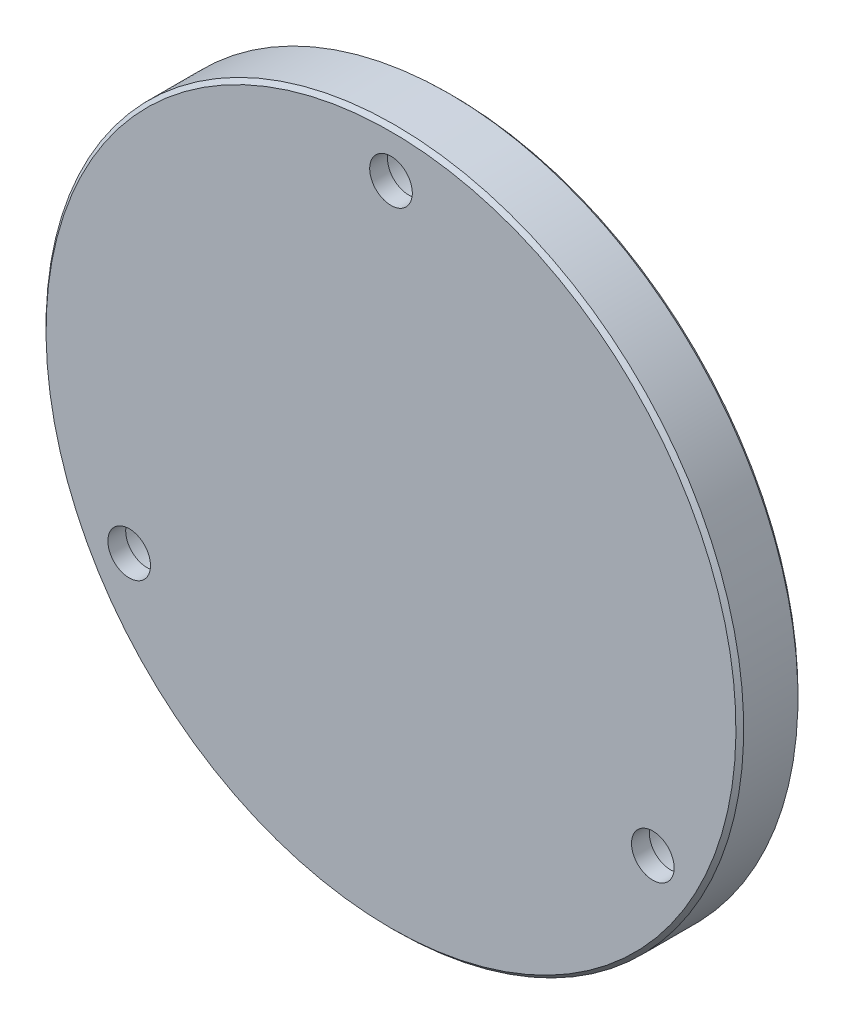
ISO-10303-21;
HEADER;
FILE_DESCRIPTION(('STEP AP214'),'2;1');
FILE_NAME('part.step','',(''),(''),'','','');
FILE_SCHEMA(('AUTOMOTIVE_DESIGN { 1 0 10303 214 1 1 1 1 }'));
ENDSEC;
DATA;
#1=APPLICATION_CONTEXT('core data for automotive mechanical design processes');
#2=APPLICATION_PROTOCOL_DEFINITION('international standard','automotive_design',2000,#1);
#3=PRODUCT_CONTEXT('',#1,'mechanical');
#4=PRODUCT('Part','Part','',(#3));
#5=PRODUCT_RELATED_PRODUCT_CATEGORY('part','',(#4));
#6=PRODUCT_DEFINITION_FORMATION('','',#4);
#7=PRODUCT_DEFINITION_CONTEXT('part definition',#1,'design');
#8=PRODUCT_DEFINITION('design','',#6,#7);
#9=PRODUCT_DEFINITION_SHAPE('','',#8);
#10=(LENGTH_UNIT() NAMED_UNIT(*) SI_UNIT(.MILLI.,.METRE.));
#11=(NAMED_UNIT(*) PLANE_ANGLE_UNIT() SI_UNIT($,.RADIAN.));
#12=(NAMED_UNIT(*) SI_UNIT($,.STERADIAN.) SOLID_ANGLE_UNIT());
#13=UNCERTAINTY_MEASURE_WITH_UNIT(LENGTH_MEASURE(1.E-05),#10,'distance_accuracy_value','');
#14=(GEOMETRIC_REPRESENTATION_CONTEXT(3) GLOBAL_UNCERTAINTY_ASSIGNED_CONTEXT((#13)) GLOBAL_UNIT_ASSIGNED_CONTEXT((#10,
#11,#12)) REPRESENTATION_CONTEXT('',''));
#15=CARTESIAN_POINT('',(0.,0.,0.));
#16=DIRECTION('',(0.,0.,1.));
#17=DIRECTION('',(1.,0.,0.));
#18=AXIS2_PLACEMENT_3D('',#15,#16,#17);
#19=CARTESIAN_POINT('',(0.,44.5,3.99999999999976));
#20=DIRECTION('',(0.,0.,-1.));
#21=DIRECTION('',(0.,1.,0.));
#22=AXIS2_PLACEMENT_3D('',#19,#20,#21);
#23=PLANE('',#22);
#24=CARTESIAN_POINT('',(0.,39.,4.00000000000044));
#25=DIRECTION('',(0.,0.,-1.));
#26=DIRECTION('',(-1.,0.,0.));
#27=AXIS2_PLACEMENT_3D('',#24,#25,#26);
#28=CIRCLE('',#27,2.75);
#29=CARTESIAN_POINT('',(-2.75000000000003,39.,4.00000000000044));
#30=VERTEX_POINT('',#29);
#31=EDGE_CURVE('E75',#30,#30,#28,.T.);
#32=ORIENTED_EDGE('',*,*,#31,.T.);
#33=EDGE_LOOP('',(#32));
#34=FACE_BOUND('',#33,.T.);
#35=CARTESIAN_POINT('',(-33.7749907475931,-19.5,4.00000000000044));
#36=DIRECTION('',(0.,0.,-1.));
#37=DIRECTION('',(-1.,0.,0.));
#38=AXIS2_PLACEMENT_3D('',#35,#36,#37);
#39=CIRCLE('',#38,2.75);
#40=CARTESIAN_POINT('',(-36.5249907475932,-19.5,4.00000000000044));
#41=VERTEX_POINT('',#40);
#42=EDGE_CURVE('E63',#41,#41,#39,.T.);
#43=ORIENTED_EDGE('',*,*,#42,.T.);
#44=EDGE_LOOP('',(#43));
#45=FACE_BOUND('',#44,.T.);
#46=CARTESIAN_POINT('',(33.7749907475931,-19.5,4.00000000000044));
#47=DIRECTION('',(0.,0.,-1.));
#48=DIRECTION('',(-1.,0.,0.));
#49=AXIS2_PLACEMENT_3D('',#46,#47,#48);
#50=CIRCLE('',#49,2.75);
#51=CARTESIAN_POINT('',(31.0249907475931,-19.5,4.00000000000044));
#52=VERTEX_POINT('',#51);
#53=EDGE_CURVE('E51',#52,#52,#50,.T.);
#54=ORIENTED_EDGE('',*,*,#53,.T.);
#55=EDGE_LOOP('',(#54));
#56=FACE_BOUND('',#55,.T.);
#57=CARTESIAN_POINT('',(0.,0.,4.00000000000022));
#58=DIRECTION('',(0.,0.,1.));
#59=DIRECTION('',(0.,-1.,0.));
#60=AXIS2_PLACEMENT_3D('',#57,#58,#59);
#61=CIRCLE('',#60,44.5);
#62=CARTESIAN_POINT('',(0.,-44.4999999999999,4.00000000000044));
#63=VERTEX_POINT('',#62);
#64=EDGE_CURVE('E46',#63,#63,#61,.T.);
#65=ORIENTED_EDGE('',*,*,#64,.T.);
#66=EDGE_LOOP('',(#65));
#67=FACE_BOUND('',#66,.T.);
#68=ADVANCED_FACE('F32',(#34,#45,#56,#67),#23,.F.);
#69=CARTESIAN_POINT('',(0.,0.,-4.00000000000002));
#70=DIRECTION('',(0.,0.,1.));
#71=DIRECTION('',(0.,-1.,0.));
#72=AXIS2_PLACEMENT_3D('',#69,#70,#71);
#73=PLANE('',#72);
#74=CARTESIAN_POINT('',(0.,39.,-4.00000000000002));
#75=DIRECTION('',(0.,0.,-1.));
#76=DIRECTION('',(-1.,0.,0.));
#77=AXIS2_PLACEMENT_3D('',#74,#75,#76);
#78=CIRCLE('',#77,5.);
#79=CARTESIAN_POINT('',(-5.00000000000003,39.,-4.00000000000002));
#80=VERTEX_POINT('',#79);
#81=EDGE_CURVE('E84',#80,#80,#78,.T.);
#82=ORIENTED_EDGE('',*,*,#81,.F.);
#83=EDGE_LOOP('',(#82));
#84=FACE_BOUND('',#83,.T.);
#85=CARTESIAN_POINT('',(-33.7749907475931,-19.5,-4.00000000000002));
#86=DIRECTION('',(0.,0.,-1.));
#87=DIRECTION('',(-1.,0.,0.));
#88=AXIS2_PLACEMENT_3D('',#85,#86,#87);
#89=CIRCLE('',#88,5.);
#90=CARTESIAN_POINT('',(-38.7749907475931,-19.5,-4.00000000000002));
#91=VERTEX_POINT('',#90);
#92=EDGE_CURVE('E72',#91,#91,#89,.T.);
#93=ORIENTED_EDGE('',*,*,#92,.F.);
#94=EDGE_LOOP('',(#93));
#95=FACE_BOUND('',#94,.T.);
#96=CARTESIAN_POINT('',(33.7749907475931,-19.5,-4.00000000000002));
#97=DIRECTION('',(0.,0.,-1.));
#98=DIRECTION('',(-1.,0.,0.));
#99=AXIS2_PLACEMENT_3D('',#96,#97,#98);
#100=CIRCLE('',#99,5.);
#101=CARTESIAN_POINT('',(28.7749907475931,-19.5,-4.00000000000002));
#102=VERTEX_POINT('',#101);
#103=EDGE_CURVE('E60',#102,#102,#100,.T.);
#104=ORIENTED_EDGE('',*,*,#103,.F.);
#105=EDGE_LOOP('',(#104));
#106=FACE_BOUND('',#105,.T.);
#107=CARTESIAN_POINT('',(0.,0.,-3.99999999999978));
#108=DIRECTION('',(0.,0.,1.));
#109=DIRECTION('',(0.,-1.,0.));
#110=AXIS2_PLACEMENT_3D('',#107,#108,#109);
#111=CIRCLE('',#110,44.5);
#112=CARTESIAN_POINT('',(0.,-44.5,-3.99999999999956));
#113=VERTEX_POINT('',#112);
#114=EDGE_CURVE('E10',#113,#113,#111,.T.);
#115=ORIENTED_EDGE('',*,*,#114,.F.);
#116=EDGE_LOOP('',(#115));
#117=FACE_BOUND('',#116,.T.);
#118=ADVANCED_FACE('F90',(#84,#95,#106,#117),#73,.F.);
#119=CARTESIAN_POINT('',(0.,0.,-3.99999999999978));
#120=DIRECTION('',(0.,0.,1.));
#121=DIRECTION('',(0.,-1.,0.));
#122=AXIS2_PLACEMENT_3D('',#119,#120,#121);
#123=CONICAL_SURFACE('',#122,44.5,0.785398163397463);
#124=CARTESIAN_POINT('',(0.,0.,-3.49999999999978));
#125=DIRECTION('',(0.,0.,1.));
#126=DIRECTION('',(0.,-1.,0.));
#127=AXIS2_PLACEMENT_3D('',#124,#125,#126);
#128=CIRCLE('',#127,45.);
#129=CARTESIAN_POINT('',(0.,-45.,-3.49999999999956));
#130=VERTEX_POINT('',#129);
#131=EDGE_CURVE('E38',#130,#130,#128,.T.);
#132=ORIENTED_EDGE('',*,*,#131,.F.);
#133=EDGE_LOOP('',(#132));
#134=FACE_BOUND('',#133,.T.);
#135=ORIENTED_EDGE('',*,*,#114,.T.);
#136=EDGE_LOOP('',(#135));
#137=FACE_BOUND('',#136,.T.);
#138=ADVANCED_FACE('F93',(#134,#137),#123,.T.);
#139=CARTESIAN_POINT('',(0.,0.,-4.00000000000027));
#140=DIRECTION('',(0.,0.,1.));
#141=DIRECTION('',(0.,-1.,0.));
#142=AXIS2_PLACEMENT_3D('',#139,#140,#141);
#143=CYLINDRICAL_SURFACE('',#142,45.);
#144=CARTESIAN_POINT('',(0.,0.,3.50000000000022));
#145=DIRECTION('',(0.,0.,1.));
#146=DIRECTION('',(0.,-1.,0.));
#147=AXIS2_PLACEMENT_3D('',#144,#145,#146);
#148=CIRCLE('',#147,45.);
#149=CARTESIAN_POINT('',(0.,-44.9999999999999,3.50000000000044));
#150=VERTEX_POINT('',#149);
#151=EDGE_CURVE('E42',#150,#150,#148,.T.);
#152=ORIENTED_EDGE('',*,*,#151,.F.);
#153=EDGE_LOOP('',(#152));
#154=FACE_BOUND('',#153,.T.);
#155=ORIENTED_EDGE('',*,*,#131,.T.);
#156=EDGE_LOOP('',(#155));
#157=FACE_BOUND('',#156,.T.);
#158=ADVANCED_FACE('F131',(#154,#157),#143,.T.);
#159=CARTESIAN_POINT('',(0.,0.,3.50000000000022));
#160=DIRECTION('',(0.,0.,-1.));
#161=DIRECTION('',(0.,1.,0.));
#162=AXIS2_PLACEMENT_3D('',#159,#160,#161);
#163=CONICAL_SURFACE('',#162,45.,0.78539816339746);
#164=ORIENTED_EDGE('',*,*,#64,.F.);
#165=EDGE_LOOP('',(#164));
#166=FACE_BOUND('',#165,.T.);
#167=ORIENTED_EDGE('',*,*,#151,.T.);
#168=EDGE_LOOP('',(#167));
#169=FACE_BOUND('',#168,.T.);
#170=ADVANCED_FACE('F128',(#166,#169),#163,.T.);
#171=CARTESIAN_POINT('',(33.7749907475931,-19.5,-4.00000000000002));
#172=DIRECTION('',(0.,0.,-1.));
#173=DIRECTION('',(-1.,0.,0.));
#174=AXIS2_PLACEMENT_3D('',#171,#172,#173);
#175=CYLINDRICAL_SURFACE('',#174,2.75);
#176=ORIENTED_EDGE('',*,*,#53,.F.);
#177=EDGE_LOOP('',(#176));
#178=FACE_BOUND('',#177,.T.);
#179=CARTESIAN_POINT('',(33.7749907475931,-19.5,1.69999999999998));
#180=DIRECTION('',(0.,0.,-1.));
#181=DIRECTION('',(-1.,0.,0.));
#182=AXIS2_PLACEMENT_3D('',#179,#180,#181);
#183=CIRCLE('',#182,2.75);
#184=CARTESIAN_POINT('',(31.0249907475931,-19.5,1.69999999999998));
#185=VERTEX_POINT('',#184);
#186=EDGE_CURVE('E54',#185,#185,#183,.T.);
#187=ORIENTED_EDGE('',*,*,#186,.T.);
#188=EDGE_LOOP('',(#187));
#189=FACE_BOUND('',#188,.T.);
#190=ADVANCED_FACE('F112',(#178,#189),#175,.F.);
#191=CARTESIAN_POINT('',(36.5249907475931,-19.5,1.69999999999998));
#192=DIRECTION('',(0.,0.,1.));
#193=DIRECTION('',(1.,0.,0.));
#194=AXIS2_PLACEMENT_3D('',#191,#192,#193);
#195=PLANE('',#194);
#196=ORIENTED_EDGE('',*,*,#186,.F.);
#197=EDGE_LOOP('',(#196));
#198=FACE_BOUND('',#197,.T.);
#199=CARTESIAN_POINT('',(33.7749907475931,-19.5,1.69999999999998));
#200=DIRECTION('',(0.,0.,-1.));
#201=DIRECTION('',(-1.,0.,0.));
#202=AXIS2_PLACEMENT_3D('',#199,#200,#201);
#203=CIRCLE('',#202,5.);
#204=CARTESIAN_POINT('',(28.7749907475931,-19.5,1.69999999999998));
#205=VERTEX_POINT('',#204);
#206=EDGE_CURVE('E57',#205,#205,#203,.T.);
#207=ORIENTED_EDGE('',*,*,#206,.T.);
#208=EDGE_LOOP('',(#207));
#209=FACE_BOUND('',#208,.T.);
#210=ADVANCED_FACE('F102',(#198,#209),#195,.F.);
#211=CARTESIAN_POINT('',(33.7749907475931,-19.5,-4.00000000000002));
#212=DIRECTION('',(0.,0.,-1.));
#213=DIRECTION('',(-1.,0.,0.));
#214=AXIS2_PLACEMENT_3D('',#211,#212,#213);
#215=CYLINDRICAL_SURFACE('',#214,5.);
#216=ORIENTED_EDGE('',*,*,#206,.F.);
#217=EDGE_LOOP('',(#216));
#218=FACE_BOUND('',#217,.T.);
#219=ORIENTED_EDGE('',*,*,#103,.T.);
#220=EDGE_LOOP('',(#219));
#221=FACE_BOUND('',#220,.T.);
#222=ADVANCED_FACE('F99',(#218,#221),#215,.F.);
#223=CARTESIAN_POINT('',(-33.7749907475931,-19.5,-4.00000000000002));
#224=DIRECTION('',(0.,0.,-1.));
#225=DIRECTION('',(-1.,0.,0.));
#226=AXIS2_PLACEMENT_3D('',#223,#224,#225);
#227=CYLINDRICAL_SURFACE('',#226,2.75);
#228=ORIENTED_EDGE('',*,*,#42,.F.);
#229=EDGE_LOOP('',(#228));
#230=FACE_BOUND('',#229,.T.);
#231=CARTESIAN_POINT('',(-33.7749907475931,-19.5,1.69999999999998));
#232=DIRECTION('',(0.,0.,-1.));
#233=DIRECTION('',(-1.,0.,0.));
#234=AXIS2_PLACEMENT_3D('',#231,#232,#233);
#235=CIRCLE('',#234,2.75);
#236=CARTESIAN_POINT('',(-36.5249907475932,-19.5,1.69999999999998));
#237=VERTEX_POINT('',#236);
#238=EDGE_CURVE('E66',#237,#237,#235,.T.);
#239=ORIENTED_EDGE('',*,*,#238,.T.);
#240=EDGE_LOOP('',(#239));
#241=FACE_BOUND('',#240,.T.);
#242=ADVANCED_FACE('F101',(#230,#241),#227,.F.);
#243=CARTESIAN_POINT('',(-31.0249907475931,-19.5,1.69999999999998));
#244=DIRECTION('',(0.,0.,1.));
#245=DIRECTION('',(1.,0.,0.));
#246=AXIS2_PLACEMENT_3D('',#243,#244,#245);
#247=PLANE('',#246);
#248=ORIENTED_EDGE('',*,*,#238,.F.);
#249=EDGE_LOOP('',(#248));
#250=FACE_BOUND('',#249,.T.);
#251=CARTESIAN_POINT('',(-33.7749907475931,-19.5,1.69999999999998));
#252=DIRECTION('',(0.,0.,-1.));
#253=DIRECTION('',(-1.,0.,0.));
#254=AXIS2_PLACEMENT_3D('',#251,#252,#253);
#255=CIRCLE('',#254,5.);
#256=CARTESIAN_POINT('',(-38.7749907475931,-19.5,1.69999999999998));
#257=VERTEX_POINT('',#256);
#258=EDGE_CURVE('E69',#257,#257,#255,.T.);
#259=ORIENTED_EDGE('',*,*,#258,.T.);
#260=EDGE_LOOP('',(#259));
#261=FACE_BOUND('',#260,.T.);
#262=ADVANCED_FACE('F109',(#250,#261),#247,.F.);
#263=CARTESIAN_POINT('',(-33.7749907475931,-19.5,-4.00000000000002));
#264=DIRECTION('',(0.,0.,-1.));
#265=DIRECTION('',(-1.,0.,0.));
#266=AXIS2_PLACEMENT_3D('',#263,#264,#265);
#267=CYLINDRICAL_SURFACE('',#266,5.);
#268=ORIENTED_EDGE('',*,*,#258,.F.);
#269=EDGE_LOOP('',(#268));
#270=FACE_BOUND('',#269,.T.);
#271=ORIENTED_EDGE('',*,*,#92,.T.);
#272=EDGE_LOOP('',(#271));
#273=FACE_BOUND('',#272,.T.);
#274=ADVANCED_FACE('F176',(#270,#273),#267,.F.);
#275=CARTESIAN_POINT('',(0.,39.,-4.00000000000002));
#276=DIRECTION('',(0.,0.,-1.));
#277=DIRECTION('',(-1.,0.,0.));
#278=AXIS2_PLACEMENT_3D('',#275,#276,#277);
#279=CYLINDRICAL_SURFACE('',#278,2.75);
#280=ORIENTED_EDGE('',*,*,#31,.F.);
#281=EDGE_LOOP('',(#280));
#282=FACE_BOUND('',#281,.T.);
#283=CARTESIAN_POINT('',(0.,39.,1.69999999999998));
#284=DIRECTION('',(0.,0.,-1.));
#285=DIRECTION('',(-1.,0.,0.));
#286=AXIS2_PLACEMENT_3D('',#283,#284,#285);
#287=CIRCLE('',#286,2.75);
#288=CARTESIAN_POINT('',(-2.75000000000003,39.,1.69999999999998));
#289=VERTEX_POINT('',#288);
#290=EDGE_CURVE('E78',#289,#289,#287,.T.);
#291=ORIENTED_EDGE('',*,*,#290,.T.);
#292=EDGE_LOOP('',(#291));
#293=FACE_BOUND('',#292,.T.);
#294=ADVANCED_FACE('F186',(#282,#293),#279,.F.);
#295=CARTESIAN_POINT('',(2.74999999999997,39.,1.69999999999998));
#296=DIRECTION('',(0.,0.,1.));
#297=DIRECTION('',(1.,0.,0.));
#298=AXIS2_PLACEMENT_3D('',#295,#296,#297);
#299=PLANE('',#298);
#300=ORIENTED_EDGE('',*,*,#290,.F.);
#301=EDGE_LOOP('',(#300));
#302=FACE_BOUND('',#301,.T.);
#303=CARTESIAN_POINT('',(0.,39.,1.69999999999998));
#304=DIRECTION('',(0.,0.,-1.));
#305=DIRECTION('',(-1.,0.,0.));
#306=AXIS2_PLACEMENT_3D('',#303,#304,#305);
#307=CIRCLE('',#306,5.);
#308=CARTESIAN_POINT('',(-5.00000000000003,39.,1.69999999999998));
#309=VERTEX_POINT('',#308);
#310=EDGE_CURVE('E81',#309,#309,#307,.T.);
#311=ORIENTED_EDGE('',*,*,#310,.T.);
#312=EDGE_LOOP('',(#311));
#313=FACE_BOUND('',#312,.T.);
#314=ADVANCED_FACE('F196',(#302,#313),#299,.F.);
#315=CARTESIAN_POINT('',(0.,39.,-4.00000000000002));
#316=DIRECTION('',(0.,0.,-1.));
#317=DIRECTION('',(-1.,0.,0.));
#318=AXIS2_PLACEMENT_3D('',#315,#316,#317);
#319=CYLINDRICAL_SURFACE('',#318,5.);
#320=ORIENTED_EDGE('',*,*,#310,.F.);
#321=EDGE_LOOP('',(#320));
#322=FACE_BOUND('',#321,.T.);
#323=ORIENTED_EDGE('',*,*,#81,.T.);
#324=EDGE_LOOP('',(#323));
#325=FACE_BOUND('',#324,.T.);
#326=ADVANCED_FACE('F88',(#322,#325),#319,.F.);
#327=CLOSED_SHELL('',(#68,#118,#138,#158,#170,#190,#210,#222,#242,#262,#274,#294,#314,#326));
#328=MANIFOLD_SOLID_BREP('B2',#327);
#329=ADVANCED_BREP_SHAPE_REPRESENTATION('',(#18,#328),#14);
#330=SHAPE_DEFINITION_REPRESENTATION(#9,#329);
ENDSEC;
END-ISO-10303-21;
